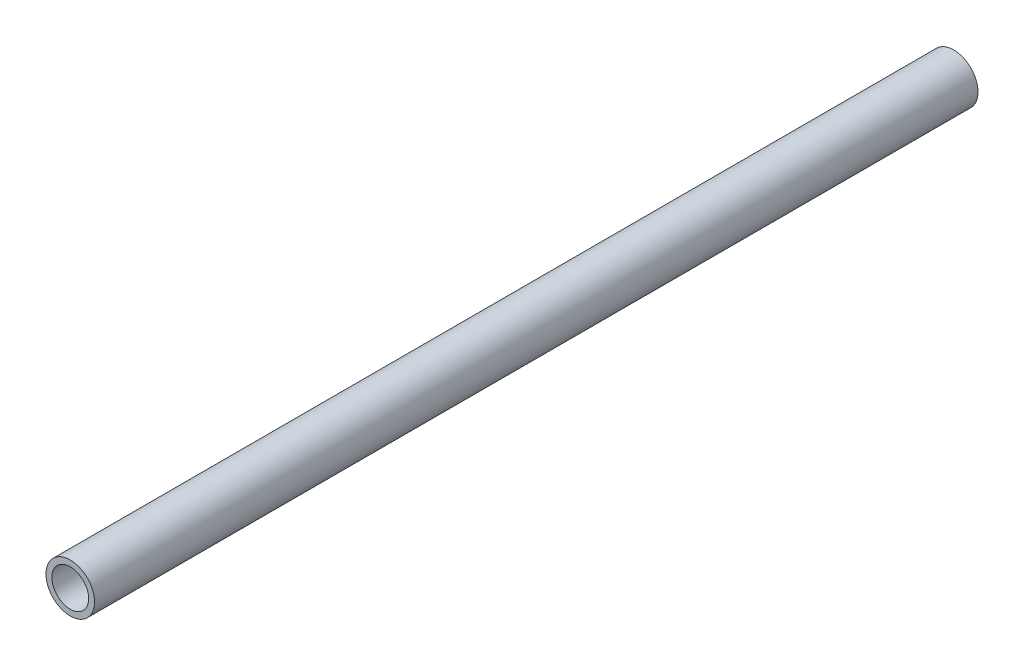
from build123d import *

# Parameters (mm, degrees)
ESQUISSE1_R        = 8.25
ESQUISSE1_R_2      = 6.25
BOSS_EXTRU_1_DEPTH = 300


with BuildPart() as part:
    # Esquisse1 → Boss.-Extru.1 (new body)
    with BuildSketch(Plane.XY):
        Circle(ESQUISSE1_R)
        Circle(ESQUISSE1_R_2, mode=Mode.SUBTRACT)
    extrude(amount=BOSS_EXTRU_1_DEPTH)


solid = part.part
